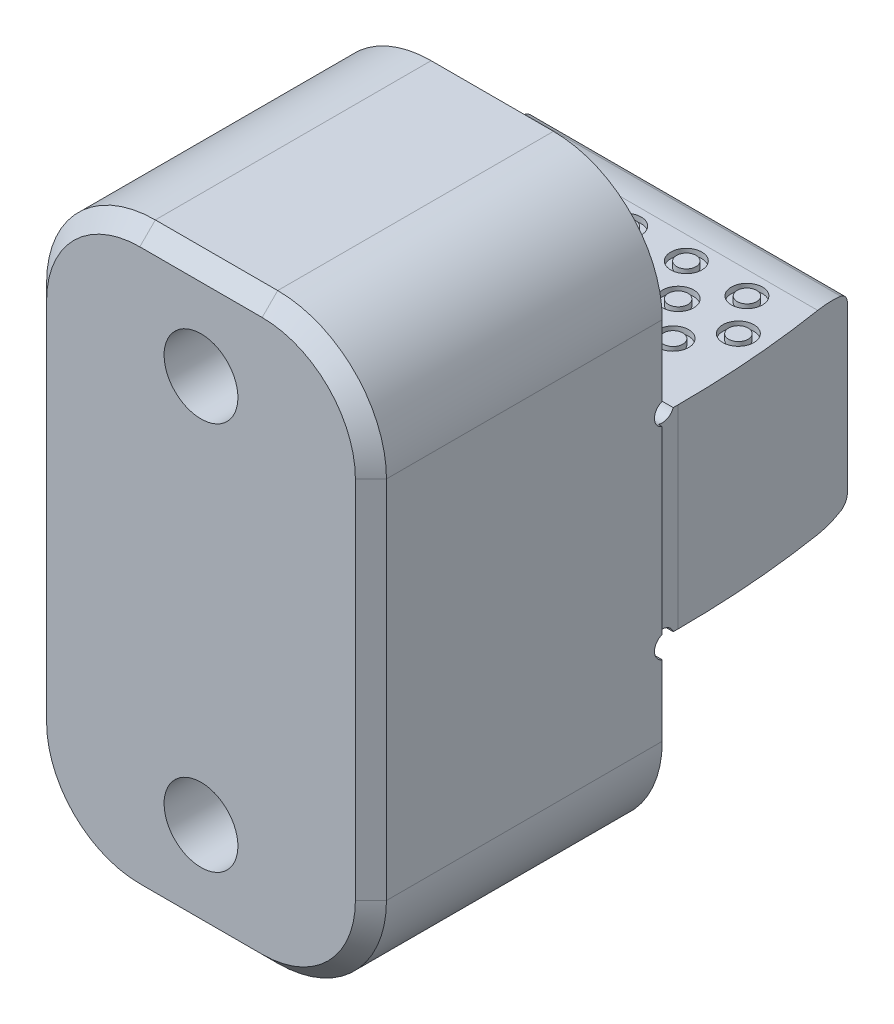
from build123d import *

# Parameters (mm, degrees)
EXTRUDE1_DEPTH         = 11.1125
SKETCH7_W              = 21.968267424
SKETCH7_H              = 31.720833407
CUT_EXTRUDE3_DEPTH     = 0.254
SKETCH8_R              = 0.762
CUT_EXTRUDE4_DEPTH     = 35.925
CUT_EXTRUDE5_DEPTH     = 35.925
CUT_EXTRUDE6_DEPTH     = 45.022723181
SKETCH15_R             = 1.016
SKETCH15_R_2           = 0.635
CUT_EXTRUDE7_DEPTH     = 0.381
F_8_CBORE_D            = 3.81
F_8_CBORE_CBORE_D      = 7.9375
F_8_CBORE_CBORE_DEPTH  = 4.96062
F_10_32_TAPPED_HOLE1_D = 4.826
FILLET1_R              = 7.112
CHAMFER1_SIZE          = 1.016


with BuildPart() as part:
    # Sketch3 → Extrude1 (new, symmetric)
    with BuildSketch(Plane(origin=(0, 0, 0), x_dir=(0, 0, -1), z_dir=(1, 0, 0))):
        Polygon((-19.05, -19.05), (0, -19.05), (0, -6.34746), (13.5636, -6.34746), (13.5636, 6.34746), (0, 6.34746), (0, 19.05), (-19.05, 19.05), align=None)
    extrude(amount=EXTRUDE1_DEPTH, both=True)

    # Sketch7 → Cut-Extrude3 (cut)
    with BuildSketch(Plane(origin=(11.1125, 0, 0), x_dir=(0, 0, -1), z_dir=(1, 0, 0))):
        with Locations((10.984133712, 1.307835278)):
            Rectangle(SKETCH7_W, SKETCH7_H)
    cut_extrude3 = extrude(amount=-CUT_EXTRUDE3_DEPTH, mode=Mode.SUBTRACT)

    # Mirror2: Cut-Extrude3 across plane
    add(cut_extrude3.mirror(Plane(origin=(0, 0, 0), x_dir=(0, 0, 1), z_dir=(1, 0, 0))), mode=Mode.SUBTRACT)

    # Sketch8 → Cut-Extrude4 (cut, through all)
    with BuildSketch(Plane(origin=(11.1125, 0, 0), x_dir=(0, 0, -1), z_dir=(1, 0, 0))):
        with Locations((0.254, 6.60146)):
            Circle(SKETCH8_R)
        with Locations((0.254, -6.60146)):
            Circle(SKETCH8_R)
    extrude(amount=-CUT_EXTRUDE4_DEPTH, mode=Mode.SUBTRACT)

    # Sketch9 → Cut-Extrude5 (cut, through all)
    with BuildSketch(Plane(origin=(11.1125, 0, 0), x_dir=(0, 0, -1), z_dir=(1, 0, 0))):
        with BuildLine():
            Line((13.5636, 5.351440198), (17.5514, 5.351440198))
            Line((17.5514, 5.351440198), (17.5514, 11.701440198))
            Line((17.5514, 11.701440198), (11.2014, 11.701440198))
            Line((11.2014, 11.701440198), (11.2014, 6.34746))
            ThreePointArc((11.2014, 6.34746), (12.12027584, 6.28062538), (13.019809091, 6.081528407))
            ThreePointArc((13.019809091, 6.081528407), (13.412713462, 5.806615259), (13.5636, 5.351440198))
        make_face()
        with BuildLine():
            Line((17.5514, -5.351440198), (17.5514, -11.701440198))
            Line((17.5514, -11.701440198), (11.2014, -11.701440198))
            Line((11.2014, -11.701440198), (11.2014, -6.34746))
            ThreePointArc((11.2014, -6.34746), (12.12027584, -6.28062538), (13.019809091, -6.081528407))
            ThreePointArc((13.019809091, -6.081528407), (13.412713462, -5.806615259), (13.5636, -5.351440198))
            Line((13.5636, -5.351440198), (17.5514, -5.351440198))
        make_face()
    extrude(amount=-CUT_EXTRUDE5_DEPTH, mode=Mode.SUBTRACT)

    # Sketch13 → Cut-Extrude6 (cut, through all)
    with BuildSketch(Plane(origin=(0, 19.05, 0), x_dir=(1, 0, 0), z_dir=(0, 1, 0))):
        with BuildLine():
            Line((9.575539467, 13.97), (22.275539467, 13.97))
            Line((22.275539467, 13.97), (22.275539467, 1.27))
            Line((22.275539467, 1.27), (10.8585, 1.27))
            ThreePointArc((10.8585, 1.27), (10.536945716, 7.652319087), (9.575539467, 13.97))
        make_face()
    extrude(amount=-CUT_EXTRUDE6_DEPTH, mode=Mode.SUBTRACT)

    # Sketch15 → Cut-Extrude7 (cut)
    # profile 1 of 15: a face of its own
    with BuildSketch(Plane(origin=(0, 6.34746, 0), x_dir=(1, 0, 0), z_dir=(0, 1, 0))):
        with Locations(Location((-4.9403, 9.7028, 0), (0, 0, 270))):
            Circle(SKETCH15_R)
        with Locations(Location((-4.9403, 9.7028, 0), (0, 0, 270))):
            Circle(SKETCH15_R_2, mode=Mode.SUBTRACT)
    # profile 2 of 15: a face of its own
    with BuildSketch(Plane(origin=(0, 6.34746, 0), x_dir=(1, 0, 0), z_dir=(0, 1, 0))):
        with Locations(Location((-0.9779, 9.7028, 0), (0, 0, 270))):
            Circle(SKETCH15_R)
        with Locations(Location((-0.9779, 9.7028, 0), (0, 0, 270))):
            Circle(SKETCH15_R_2, mode=Mode.SUBTRACT)
    # profile 3 of 15: a face of its own
    with BuildSketch(Plane(origin=(0, 6.34746, 0), x_dir=(1, 0, 0), z_dir=(0, 1, 0))):
        with Locations(Location((-8.9027, 9.7028, 0), (0, 0, 270))):
            Circle(SKETCH15_R)
        with Locations(Location((-8.9027, 9.7028, 0), (0, 0, 270))):
            Circle(SKETCH15_R_2, mode=Mode.SUBTRACT)
    # profile 4 of 15: a face of its own
    with BuildSketch(Plane(origin=(0, 6.34746, 0), x_dir=(1, 0, 0), z_dir=(0, 1, 0))):
        with Locations(Location((2.9845, 9.7028, 0), (0, 0, 270))):
            Circle(SKETCH15_R)
        with Locations(Location((2.9845, 9.7028, 0), (0, 0, 270))):
            Circle(SKETCH15_R_2, mode=Mode.SUBTRACT)
    # profile 5 of 15: a face of its own
    with BuildSketch(Plane(origin=(0, 6.34746, 0), x_dir=(1, 0, 0), z_dir=(0, 1, 0))):
        with Locations(Location((6.9469, 9.7028, 0), (0, 0, 270))):
            Circle(SKETCH15_R)
        with Locations(Location((6.9469, 9.7028, 0), (0, 0, 270))):
            Circle(SKETCH15_R_2, mode=Mode.SUBTRACT)
    # profile 6 of 15: a face of its own
    with BuildSketch(Plane(origin=(0, 6.34746, 0), x_dir=(1, 0, 0), z_dir=(0, 1, 0))):
        with Locations(Location((-3.0099, 7.2898, 0), (0, 0, 270))):
            Circle(SKETCH15_R)
        with Locations(Location((-3.0099, 7.2898, 0), (0, 0, 270))):
            Circle(SKETCH15_R_2, mode=Mode.SUBTRACT)
    # profile 7 of 15: a face of its own
    with BuildSketch(Plane(origin=(0, 6.34746, 0), x_dir=(1, 0, 0), z_dir=(0, 1, 0))):
        with Locations(Location((0.9271, 7.2898, 0), (0, 0, 270))):
            Circle(SKETCH15_R)
        with Locations(Location((0.9271, 7.2898, 0), (0, 0, 270))):
            Circle(SKETCH15_R_2, mode=Mode.SUBTRACT)
    # profile 8 of 15: a face of its own
    with BuildSketch(Plane(origin=(0, 6.34746, 0), x_dir=(1, 0, 0), z_dir=(0, 1, 0))):
        with Locations(Location((-6.9469, 7.2898, 0), (0, 0, 270))):
            Circle(SKETCH15_R)
        with Locations(Location((-6.9469, 7.2898, 0), (0, 0, 270))):
            Circle(SKETCH15_R_2, mode=Mode.SUBTRACT)
    # profile 9 of 15: a face of its own
    with BuildSketch(Plane(origin=(0, 6.34746, 0), x_dir=(1, 0, 0), z_dir=(0, 1, 0))):
        with Locations(Location((4.8641, 7.2898, 0), (0, 0, 270))):
            Circle(SKETCH15_R)
        with Locations(Location((4.8641, 7.2898, 0), (0, 0, 270))):
            Circle(SKETCH15_R_2, mode=Mode.SUBTRACT)
    # profile 10 of 15: a face of its own
    with BuildSketch(Plane(origin=(0, 6.34746, 0), x_dir=(1, 0, 0), z_dir=(0, 1, 0))):
        with Locations(Location((8.8011, 7.2898, 0), (0, 0, 270))):
            Circle(SKETCH15_R)
        with Locations(Location((8.8011, 7.2898, 0), (0, 0, 270))):
            Circle(SKETCH15_R_2, mode=Mode.SUBTRACT)
    # profile 11 of 15: a face of its own
    with BuildSketch(Plane(origin=(0, 6.34746, 0), x_dir=(1, 0, 0), z_dir=(0, 1, 0))):
        with Locations(Location((-4.9403, 4.8768, 0), (0, 0, 270))):
            Circle(SKETCH15_R)
        with Locations(Location((-4.9403, 4.8768, 0), (0, 0, 270))):
            Circle(SKETCH15_R_2, mode=Mode.SUBTRACT)
    # profile 12 of 15: a face of its own
    with BuildSketch(Plane(origin=(0, 6.34746, 0), x_dir=(1, 0, 0), z_dir=(0, 1, 0))):
        with Locations(Location((-0.9779, 4.8768, 0), (0, 0, 270))):
            Circle(SKETCH15_R)
        with Locations(Location((-0.9779, 4.8768, 0), (0, 0, 270))):
            Circle(SKETCH15_R_2, mode=Mode.SUBTRACT)
    # profile 13 of 15: a face of its own
    with BuildSketch(Plane(origin=(0, 6.34746, 0), x_dir=(1, 0, 0), z_dir=(0, 1, 0))):
        with Locations(Location((-8.9027, 4.8768, 0), (0, 0, 270))):
            Circle(SKETCH15_R)
        with Locations(Location((-8.9027, 4.8768, 0), (0, 0, 270))):
            Circle(SKETCH15_R_2, mode=Mode.SUBTRACT)
    # profile 14 of 15: a face of its own
    with BuildSketch(Plane(origin=(0, 6.34746, 0), x_dir=(1, 0, 0), z_dir=(0, 1, 0))):
        with Locations(Location((2.9845, 4.8768, 0), (0, 0, 270))):
            Circle(SKETCH15_R)
        with Locations(Location((2.9845, 4.8768, 0), (0, 0, 270))):
            Circle(SKETCH15_R_2, mode=Mode.SUBTRACT)
    # profile 15 of 15: a face of its own
    with BuildSketch(Plane(origin=(0, 6.34746, 0), x_dir=(1, 0, 0), z_dir=(0, 1, 0))):
        with Locations(Location((6.9469, 4.8768, 0), (0, 0, 270))):
            Circle(SKETCH15_R)
        with Locations(Location((6.9469, 4.8768, 0), (0, 0, 270))):
            Circle(SKETCH15_R_2, mode=Mode.SUBTRACT)
    cut_extrude7 = extrude(amount=-CUT_EXTRUDE7_DEPTH, mode=Mode.SUBTRACT)

    # Mirror1: Cut-Extrude7 across plane
    add(cut_extrude7.mirror(Plane.ZX), mode=Mode.SUBTRACT)

    # 8 CBORE (through all)
    with Locations(Plane(origin=(0, 0, 0), x_dir=(-1, 0, 0), z_dir=(0, 0, -1))):
        with Locations((0, 12.7), (0, -12.7)):
            CounterBoreHole(F_8_CBORE_D / 2, F_8_CBORE_CBORE_D / 2, F_8_CBORE_CBORE_DEPTH)

    # 10-32 Tapped Hole1 (through all)
    with Locations(Plane(origin=(0, 0, 4.96062), x_dir=(-1, 0, 0), z_dir=(0, 0, -1))):
        with Locations((0, -12.7), (0, 12.7)):
            Hole(F_10_32_TAPPED_HOLE1_D / 2)

    # Fillet1
    fillet1_edges = [part.edges().sort_by_distance(p)[0] for p in [
        (-11.1125, -19.05, 9.525),
        (11.1125, 19.05, 9.525),
        (11.1125, -19.05, 9.525),
        (-11.1125, 19.05, 9.525),
    ]]
    fillet(fillet1_edges, radius=FILLET1_R)

    # Chamfer1
    chamfer1_edges = [part.edges().sort_by_distance(p)[0] for p in [
        (11.1125, 0, 19.05),
        (0, -19.05, 19.05),
        (-11.1125, 0, 19.05),
        (0, 19.05, 19.05),
        (-9.029443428, -16.966943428, 19.05),
        (-9.029443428, 16.966943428, 19.05),
        (9.029443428, 16.966943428, 19.05),
        (9.029443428, -16.966943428, 19.05),
    ]]
    chamfer(chamfer1_edges, length=CHAMFER1_SIZE)


solid = part.part
